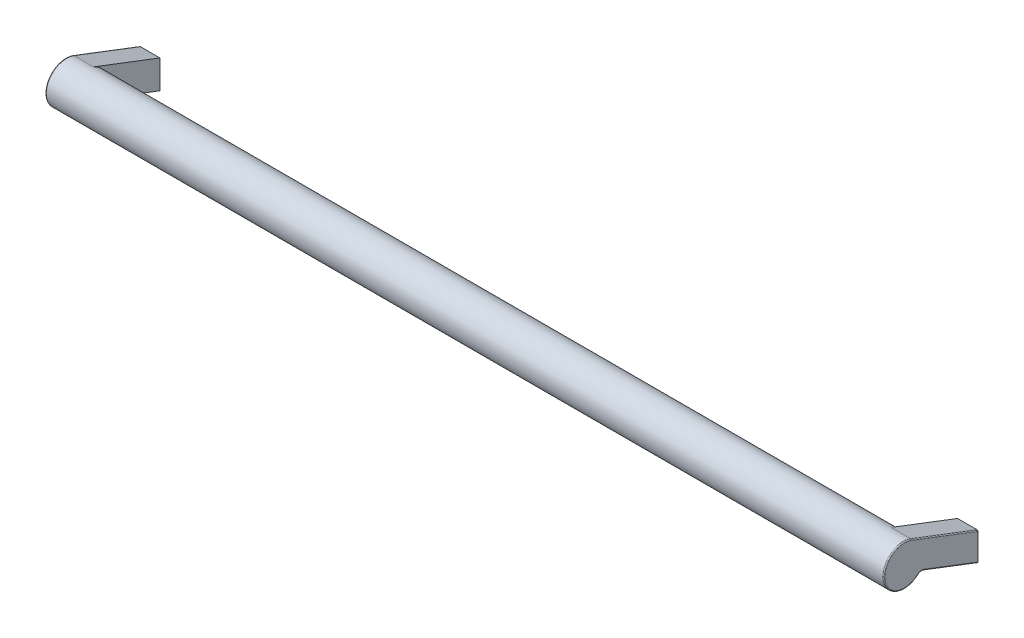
ISO-10303-21;
HEADER;
FILE_DESCRIPTION(('STEP AP214'),'2;1');
FILE_NAME('part.step','',(''),(''),'','','');
FILE_SCHEMA(('AUTOMOTIVE_DESIGN { 1 0 10303 214 1 1 1 1 }'));
ENDSEC;
DATA;
#1=APPLICATION_CONTEXT('core data for automotive mechanical design processes');
#2=APPLICATION_PROTOCOL_DEFINITION('international standard','automotive_design',2000,#1);
#3=PRODUCT_CONTEXT('',#1,'mechanical');
#4=PRODUCT('Part','Part','',(#3));
#5=PRODUCT_RELATED_PRODUCT_CATEGORY('part','',(#4));
#6=PRODUCT_DEFINITION_FORMATION('','',#4);
#7=PRODUCT_DEFINITION_CONTEXT('part definition',#1,'design');
#8=PRODUCT_DEFINITION('design','',#6,#7);
#9=PRODUCT_DEFINITION_SHAPE('','',#8);
#10=(LENGTH_UNIT() NAMED_UNIT(*) SI_UNIT(.MILLI.,.METRE.));
#11=(NAMED_UNIT(*) PLANE_ANGLE_UNIT() SI_UNIT($,.RADIAN.));
#12=(NAMED_UNIT(*) SI_UNIT($,.STERADIAN.) SOLID_ANGLE_UNIT());
#13=UNCERTAINTY_MEASURE_WITH_UNIT(LENGTH_MEASURE(1.E-05),#10,'distance_accuracy_value','');
#14=(GEOMETRIC_REPRESENTATION_CONTEXT(3) GLOBAL_UNCERTAINTY_ASSIGNED_CONTEXT((#13)) GLOBAL_UNIT_ASSIGNED_CONTEXT((#10,
#11,#12)) REPRESENTATION_CONTEXT('',''));
#15=CARTESIAN_POINT('',(0.,0.,0.));
#16=DIRECTION('',(0.,0.,1.));
#17=DIRECTION('',(1.,0.,0.));
#18=AXIS2_PLACEMENT_3D('',#15,#16,#17);
#19=CARTESIAN_POINT('',(145.,10.,36.));
#20=DIRECTION('',(1.,0.,0.));
#21=DIRECTION('',(0.,1.,0.));
#22=AXIS2_PLACEMENT_3D('',#19,#20,#21);
#23=CYLINDRICAL_SURFACE('',#22,10.);
#24=CARTESIAN_POINT('',(5.,10.,36.));
#25=DIRECTION('',(1.,0.,0.));
#26=DIRECTION('',(0.,1.,0.));
#27=AXIS2_PLACEMENT_3D('',#24,#25,#26);
#28=CIRCLE('',#27,10.);
#29=CARTESIAN_POINT('',(5.,2.30325569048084,29.6156341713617));
#30=VERTEX_POINT('',#29);
#31=CARTESIAN_POINT('',(5.,2.72629051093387,29.137555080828));
#32=VERTEX_POINT('',#31);
#33=EDGE_CURVE('E311',#30,#32,#28,.T.);
#34=ORIENTED_EDGE('',*,*,#33,.T.);
#35=CARTESIAN_POINT('',(5.,19.2986703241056,32.3210422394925));
#36=VERTEX_POINT('',#35);
#37=EDGE_CURVE('E38',#32,#36,#28,.T.);
#38=ORIENTED_EDGE('',*,*,#37,.T.);
#39=CARTESIAN_POINT('',(4.99999999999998,10.,36.));
#40=DIRECTION('',(1.,0.,0.));
#41=DIRECTION('',(0.,0.92986703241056,-0.367895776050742));
#42=AXIS2_PLACEMENT_3D('',#39,#40,#41);
#43=CIRCLE('',#42,10.);
#44=CARTESIAN_POINT('',(5.,19.3773951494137,32.5266068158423));
#45=VERTEX_POINT('',#44);
#46=EDGE_CURVE('E24',#36,#45,#43,.T.);
#47=ORIENTED_EDGE('',*,*,#46,.T.);
#48=DIRECTION('',(1.,0.,0.));
#49=VECTOR('',#48,1.);
#50=CARTESIAN_POINT('',(-5.,19.3773951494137,32.5266068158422));
#51=LINE('',#50,#49);
#52=CARTESIAN_POINT('',(-4.5,19.3773951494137,32.5266068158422));
#53=VERTEX_POINT('',#52);
#54=EDGE_CURVE('E463',#45,#53,#51,.F.);
#55=ORIENTED_EDGE('',*,*,#54,.T.);
#56=CARTESIAN_POINT('',(-4.5,10.,36.));
#57=DIRECTION('',(1.,0.,0.));
#58=DIRECTION('',(0.,1.,0.));
#59=AXIS2_PLACEMENT_3D('',#56,#57,#58);
#60=CIRCLE('',#59,10.);
#61=CARTESIAN_POINT('',(-4.5,2.30325569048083,29.6156341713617));
#62=VERTEX_POINT('',#61);
#63=EDGE_CURVE('E393',#62,#53,#60,.F.);
#64=ORIENTED_EDGE('',*,*,#63,.F.);
#65=DIRECTION('',(1.,0.,0.));
#66=VECTOR('',#65,1.);
#67=CARTESIAN_POINT('',(-5.,2.30325569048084,29.6156341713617));
#68=LINE('',#67,#66);
#69=EDGE_CURVE('E454',#62,#30,#68,.T.);
#70=ORIENTED_EDGE('',*,*,#69,.T.);
#71=EDGE_LOOP('',(#34,#38,#47,#55,#64,#70));
#72=FACE_BOUND('',#71,.T.);
#73=DIRECTION('',(1.,0.,0.));
#74=VECTOR('',#73,1.);
#75=CARTESIAN_POINT('',(395.,2.30325569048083,29.6156341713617));
#76=LINE('',#75,#74);
#77=CARTESIAN_POINT('',(395.,2.30325569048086,29.6156341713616));
#78=VERTEX_POINT('',#77);
#79=CARTESIAN_POINT('',(404.5,2.30325569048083,29.6156341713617));
#80=VERTEX_POINT('',#79);
#81=EDGE_CURVE('E198',#78,#80,#76,.T.);
#82=ORIENTED_EDGE('',*,*,#81,.T.);
#83=CARTESIAN_POINT('',(404.5,10.,36.));
#84=DIRECTION('',(1.,0.,0.));
#85=DIRECTION('',(0.,1.,0.));
#86=AXIS2_PLACEMENT_3D('',#83,#84,#85);
#87=CIRCLE('',#86,10.);
#88=CARTESIAN_POINT('',(404.5,19.3773951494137,32.5266068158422));
#89=VERTEX_POINT('',#88);
#90=EDGE_CURVE('E594',#89,#80,#87,.T.);
#91=ORIENTED_EDGE('',*,*,#90,.F.);
#92=DIRECTION('',(1.,0.,0.));
#93=VECTOR('',#92,1.);
#94=CARTESIAN_POINT('',(395.,19.3773951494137,32.5266068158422));
#95=LINE('',#94,#93);
#96=CARTESIAN_POINT('',(395.,19.3773951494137,32.5266068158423));
#97=VERTEX_POINT('',#96);
#98=EDGE_CURVE('E160',#89,#97,#95,.F.);
#99=ORIENTED_EDGE('',*,*,#98,.T.);
#100=CARTESIAN_POINT('',(395.,10.,36.));
#101=DIRECTION('',(-1.,0.,0.));
#102=DIRECTION('',(0.,0.937739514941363,-0.347339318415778));
#103=AXIS2_PLACEMENT_3D('',#100,#101,#102);
#104=CIRCLE('',#103,10.);
#105=CARTESIAN_POINT('',(395.,19.2986703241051,32.3210422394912));
#106=VERTEX_POINT('',#105);
#107=EDGE_CURVE('E154',#97,#106,#104,.T.);
#108=ORIENTED_EDGE('',*,*,#107,.T.);
#109=CARTESIAN_POINT('',(395.,10.,36.));
#110=DIRECTION('',(1.,0.,0.));
#111=DIRECTION('',(0.,1.,0.));
#112=AXIS2_PLACEMENT_3D('',#109,#110,#111);
#113=CIRCLE('',#112,10.);
#114=CARTESIAN_POINT('',(395.,2.72629051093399,29.1375550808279));
#115=VERTEX_POINT('',#114);
#116=EDGE_CURVE('E157',#115,#106,#113,.T.);
#117=ORIENTED_EDGE('',*,*,#116,.F.);
#118=CARTESIAN_POINT('',(395.,10.,36.));
#119=DIRECTION('',(1.,0.,0.));
#120=DIRECTION('',(0.,1.,0.));
#121=AXIS2_PLACEMENT_3D('',#118,#119,#120);
#122=CIRCLE('',#121,10.);
#123=EDGE_CURVE('E572',#115,#78,#122,.F.);
#124=ORIENTED_EDGE('',*,*,#123,.T.);
#125=EDGE_LOOP('',(#82,#91,#99,#108,#117,#124));
#126=FACE_BOUND('',#125,.T.);
#127=ADVANCED_FACE('F14',(#72,#126),#23,.T.);
#128=CARTESIAN_POINT('',(0.,0.,6.));
#129=DIRECTION('',(0.,0.,-1.));
#130=DIRECTION('',(1.,0.,0.));
#131=AXIS2_PLACEMENT_3D('',#128,#129,#130);
#132=PLANE('',#131);
#133=CARTESIAN_POINT('',(0.,0.,6.));
#134=DIRECTION('',(0.,0.,-1.));
#135=DIRECTION('',(1.,0.,0.));
#136=AXIS2_PLACEMENT_3D('',#133,#134,#135);
#137=CIRCLE('',#136,2.);
#138=CARTESIAN_POINT('',(2.,0.,6.));
#139=VERTEX_POINT('',#138);
#140=EDGE_CURVE('E550',#139,#139,#137,.T.);
#141=ORIENTED_EDGE('',*,*,#140,.T.);
#142=EDGE_LOOP('',(#141));
#143=FACE_BOUND('',#142,.T.);
#144=ADVANCED_FACE('F273',(#143),#132,.T.);
#145=CARTESIAN_POINT('',(-5.,0.280812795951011,27.3998443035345));
#146=DIRECTION('',(1.,0.,0.));
#147=DIRECTION('',(0.,1.,0.));
#148=AXIS2_PLACEMENT_3D('',#145,#146,#147);
#149=PLANE('',#148);
#150=CARTESIAN_POINT('',(-5.,10.,36.));
#151=DIRECTION('',(1.,0.,0.));
#152=DIRECTION('',(0.,1.,0.));
#153=AXIS2_PLACEMENT_3D('',#150,#151,#152);
#154=CIRCLE('',#153,9.5);
#155=CARTESIAN_POINT('',(-5.,19.5,36.));
#156=VERTEX_POINT('',#155);
#157=CARTESIAN_POINT('',(-5.,0.500000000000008,36.));
#158=VERTEX_POINT('',#157);
#159=EDGE_CURVE('E328',#156,#158,#154,.T.);
#160=ORIENTED_EDGE('',*,*,#159,.F.);
#161=CARTESIAN_POINT('',(-5.,10.,36.));
#162=DIRECTION('',(1.,0.,0.));
#163=DIRECTION('',(0.,0.937838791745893,-0.347071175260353));
#164=AXIS2_PLACEMENT_3D('',#161,#162,#163);
#165=CIRCLE('',#164,9.49999999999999);
#166=CARTESIAN_POINT('',(-5.,18.909468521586,32.7028238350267));
#167=VERTEX_POINT('',#166);
#168=EDGE_CURVE('E333',#167,#156,#165,.T.);
#169=ORIENTED_EDGE('',*,*,#168,.F.);
#170=DIRECTION('',(0.,0.357639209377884,0.933859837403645));
#171=VECTOR('',#170,1.);
#172=CARTESIAN_POINT('',(-5.,6.38530633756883,0.));
#173=LINE('',#172,#171);
#174=CARTESIAN_POINT('',(-5.,6.38530633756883,0.));
#175=VERTEX_POINT('',#174);
#176=EDGE_CURVE('E336',#175,#167,#173,.T.);
#177=ORIENTED_EDGE('',*,*,#176,.F.);
#178=DIRECTION('',(0.,1.,0.));
#179=VECTOR('',#178,1.);
#180=CARTESIAN_POINT('',(-5.,0.280812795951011,0.));
#181=LINE('',#180,#179);
#182=CARTESIAN_POINT('',(-5.,-6.46458774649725,0.));
#183=VERTEX_POINT('',#182);
#184=EDGE_CURVE('E340',#183,#175,#181,.T.);
#185=ORIENTED_EDGE('',*,*,#184,.F.);
#186=DIRECTION('',(0.,-0.357639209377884,-0.933859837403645));
#187=VECTOR('',#186,1.);
#188=CARTESIAN_POINT('',(-5.,3.54932222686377,26.1481070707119));
#189=LINE('',#188,#187);
#190=CARTESIAN_POINT('',(-5.,3.54932222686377,26.1481070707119));
#191=VERTEX_POINT('',#190);
#192=EDGE_CURVE('E346',#191,#183,#189,.T.);
#193=ORIENTED_EDGE('',*,*,#192,.F.);
#194=CARTESIAN_POINT('',(-5.,0.280812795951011,27.3998443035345));
#195=DIRECTION('',(-1.,0.,0.));
#196=DIRECTION('',(0.,1.,0.));
#197=AXIS2_PLACEMENT_3D('',#194,#195,#196);
#198=CIRCLE('',#197,3.5);
#199=CARTESIAN_POINT('',(-5.,3.78081279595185,27.3998443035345));
#200=VERTEX_POINT('',#199);
#201=EDGE_CURVE('E358',#200,#191,#198,.T.);
#202=ORIENTED_EDGE('',*,*,#201,.F.);
#203=CARTESIAN_POINT('',(-5.,0.280812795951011,27.3998443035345));
#204=DIRECTION('',(-1.,0.,0.));
#205=DIRECTION('',(0.,0.681805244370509,0.731533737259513));
#206=AXIS2_PLACEMENT_3D('',#203,#204,#205);
#207=CIRCLE('',#206,3.50000000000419);
#208=CARTESIAN_POINT('',(-5.,2.66713115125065,29.9602123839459));
#209=VERTEX_POINT('',#208);
#210=EDGE_CURVE('E400',#209,#200,#207,.T.);
#211=ORIENTED_EDGE('',*,*,#210,.F.);
#212=CARTESIAN_POINT('',(-5.,10.,36.));
#213=DIRECTION('',(1.,0.,0.));
#214=DIRECTION('',(0.,-1.,0.));
#215=AXIS2_PLACEMENT_3D('',#212,#213,#214);
#216=CIRCLE('',#215,9.5);
#217=EDGE_CURVE('E319',#158,#209,#216,.T.);
#218=ORIENTED_EDGE('',*,*,#217,.F.);
#219=EDGE_LOOP('',(#160,#169,#177,#185,#193,#202,#211,#218));
#220=FACE_BOUND('',#219,.T.);
#221=ADVANCED_FACE('F276',(#220),#149,.F.);
#222=CARTESIAN_POINT('',(0.,0.,6.));
#223=DIRECTION('',(0.,0.,-1.));
#224=DIRECTION('',(1.,0.,0.));
#225=AXIS2_PLACEMENT_3D('',#222,#223,#224);
#226=CYLINDRICAL_SURFACE('',#225,2.);
#227=ORIENTED_EDGE('',*,*,#140,.F.);
#228=EDGE_LOOP('',(#227));
#229=FACE_BOUND('',#228,.T.);
#230=CARTESIAN_POINT('',(0.,0.,0.));
#231=DIRECTION('',(0.,0.,-1.));
#232=DIRECTION('',(1.,0.,0.));
#233=AXIS2_PLACEMENT_3D('',#230,#231,#232);
#234=CIRCLE('',#233,2.);
#235=CARTESIAN_POINT('',(2.,0.,0.));
#236=VERTEX_POINT('',#235);
#237=EDGE_CURVE('E569',#236,#236,#234,.T.);
#238=ORIENTED_EDGE('',*,*,#237,.T.);
#239=EDGE_LOOP('',(#238));
#240=FACE_BOUND('',#239,.T.);
#241=ADVANCED_FACE('F278',(#229,#240),#226,.F.);
#242=CARTESIAN_POINT('',(-4.5,3.54932222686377,26.1481070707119));
#243=DIRECTION('',(0.,0.357639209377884,0.933859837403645));
#244=DIRECTION('',(0.,0.933859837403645,-0.357639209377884));
#245=AXIS2_PLACEMENT_3D('',#242,#243,#244);
#246=CYLINDRICAL_SURFACE('',#245,0.5);
#247=CARTESIAN_POINT('',(-4.5,3.54932222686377,26.1481070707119));
#248=DIRECTION('',(0.,0.357639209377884,0.933859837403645));
#249=DIRECTION('',(0.,0.933859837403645,-0.357639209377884));
#250=AXIS2_PLACEMENT_3D('',#247,#248,#249);
#251=CIRCLE('',#250,0.5);
#252=CARTESIAN_POINT('',(-4.5,3.08239230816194,26.3269266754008));
#253=VERTEX_POINT('',#252);
#254=EDGE_CURVE('E515',#253,#191,#251,.F.);
#255=ORIENTED_EDGE('',*,*,#254,.T.);
#256=ORIENTED_EDGE('',*,*,#192,.T.);
#257=CARTESIAN_POINT('',(-4.5,-6.46458774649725,0.));
#258=DIRECTION('',(0.,0.,1.));
#259=DIRECTION('',(0.,1.,0.));
#260=AXIS2_PLACEMENT_3D('',#257,#258,#259);
#261=ELLIPSE('',#260,0.535412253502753,0.5);
#262=CARTESIAN_POINT('',(-4.5,-7.,0.));
#263=VERTEX_POINT('',#262);
#264=EDGE_CURVE('E467',#183,#263,#261,.T.);
#265=ORIENTED_EDGE('',*,*,#264,.T.);
#266=DIRECTION('',(0.,0.357639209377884,0.933859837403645));
#267=VECTOR('',#266,1.);
#268=CARTESIAN_POINT('',(-4.5,3.08239230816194,26.3269266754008));
#269=LINE('',#268,#267);
#270=EDGE_CURVE('E560',#263,#253,#269,.T.);
#271=ORIENTED_EDGE('',*,*,#270,.T.);
#272=EDGE_LOOP('',(#255,#256,#265,#271));
#273=FACE_BOUND('',#272,.T.);
#274=ADVANCED_FACE('F281',(#273),#246,.T.);
#275=CARTESIAN_POINT('',(-4.5,0.280812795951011,27.3998443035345));
#276=DIRECTION('',(1.,0.,0.));
#277=DIRECTION('',(0.,1.,0.));
#278=AXIS2_PLACEMENT_3D('',#275,#276,#277);
#279=TOROIDAL_SURFACE('',#278,3.5,0.5);
#280=ORIENTED_EDGE('',*,*,#201,.T.);
#281=ORIENTED_EDGE('',*,*,#254,.F.);
#282=CARTESIAN_POINT('',(-4.5,0.280812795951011,27.3998443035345));
#283=DIRECTION('',(1.,0.,0.));
#284=DIRECTION('',(0.,1.,0.));
#285=AXIS2_PLACEMENT_3D('',#282,#283,#284);
#286=CIRCLE('',#285,3.);
#287=EDGE_CURVE('E528',#253,#62,#286,.T.);
#288=ORIENTED_EDGE('',*,*,#287,.T.);
#289=CARTESIAN_POINT('',(-5.,2.66713115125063,29.9602123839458));
#290=CARTESIAN_POINT('',(-5.00000003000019,2.66325531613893,29.956566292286));
#291=CARTESIAN_POINT('',(-4.99991542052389,2.65937931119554,29.9529203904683));
#292=CARTESIAN_POINT('',(-4.99957964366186,2.65168852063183,29.9456865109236));
#293=CARTESIAN_POINT('',(-4.99933096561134,2.64787367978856,29.9420984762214));
#294=CARTESIAN_POINT('',(-4.99867470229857,2.64030893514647,29.9349834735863));
#295=CARTESIAN_POINT('',(-4.99826956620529,2.63655891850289,29.9314563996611));
#296=CARTESIAN_POINT('',(-4.99730810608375,2.62912719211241,29.9244661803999));
#297=CARTESIAN_POINT('',(-4.99675418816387,2.62544531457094,29.9210028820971));
#298=CARTESIAN_POINT('',(-4.99550284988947,2.61815283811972,29.9141427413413));
#299=CARTESIAN_POINT('',(-4.99480779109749,2.61454202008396,29.9107457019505));
#300=CARTESIAN_POINT('',(-4.99328190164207,2.60739448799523,29.9040205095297));
#301=CARTESIAN_POINT('',(-4.9924533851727,2.60385750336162,29.9006921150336));
#302=CARTESIAN_POINT('',(-4.98979715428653,2.59344591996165,29.8908929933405));
#303=CARTESIAN_POINT('',(-4.98776893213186,2.58659856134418,29.8844464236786));
#304=CARTESIAN_POINT('',(-4.98325124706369,2.57322647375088,29.8718515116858));
#305=CARTESIAN_POINT('',(-4.98077911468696,2.56669853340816,29.8657003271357));
#306=CARTESIAN_POINT('',(-4.97543268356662,2.55397558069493,29.8537052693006));
#307=CARTESIAN_POINT('',(-4.97257488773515,2.54777678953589,29.8478580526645));
#308=CARTESIAN_POINT('',(-4.96651445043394,2.53571898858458,29.8364772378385));
#309=CARTESIAN_POINT('',(-4.96332745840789,2.52985569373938,29.8309398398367));
#310=CARTESIAN_POINT('',(-4.95666365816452,2.51847178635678,29.8201816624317));
#311=CARTESIAN_POINT('',(-4.95320163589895,2.51294647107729,29.8149566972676));
#312=CARTESIAN_POINT('',(-4.94604029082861,2.50223812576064,29.8048236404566));
#313=CARTESIAN_POINT('',(-4.94235488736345,2.49705005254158,29.7999110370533));
#314=CARTESIAN_POINT('',(-4.93479656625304,2.4870128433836,29.7904004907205));
#315=CARTESIAN_POINT('',(-4.93093670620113,2.48215839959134,29.7857977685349));
#316=CARTESIAN_POINT('',(-4.92307639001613,2.47278256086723,29.7769026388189));
#317=CARTESIAN_POINT('',(-4.91908814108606,2.46825566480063,29.7726052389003));
#318=CARTESIAN_POINT('',(-4.91101501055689,2.45952686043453,29.7643145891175));
#319=CARTESIAN_POINT('',(-4.90694150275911,2.45531932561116,29.7603161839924));
#320=CARTESIAN_POINT('',(-4.89873881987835,2.44721938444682,29.7526158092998));
#321=CARTESIAN_POINT('',(-4.89462020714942,2.44332128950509,29.7489085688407));
#322=CARTESIAN_POINT('',(-4.88636530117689,2.43582884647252,29.741781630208));
#323=CARTESIAN_POINT('',(-4.88223878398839,2.43222880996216,29.7383565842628));
#324=CARTESIAN_POINT('',(-4.87400305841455,2.42532009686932,29.7317838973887));
#325=CARTESIAN_POINT('',(-4.86990287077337,2.42200578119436,29.7286308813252));
#326=CARTESIAN_POINT('',(-4.8617520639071,2.41565469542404,29.7225922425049));
#327=CARTESIAN_POINT('',(-4.85770973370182,2.41261241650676,29.7197012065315));
#328=CARTESIAN_POINT('',(-4.84750942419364,2.40519799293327,29.7126579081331));
#329=CARTESIAN_POINT('',(-4.84126564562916,2.40088697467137,29.7085649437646));
#330=CARTESIAN_POINT('',(-4.82852259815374,2.39253353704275,29.700632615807));
#331=CARTESIAN_POINT('',(-4.82202532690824,2.38848950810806,29.6967917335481));
#332=CARTESIAN_POINT('',(-4.80879791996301,2.38067518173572,29.6893695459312));
#333=CARTESIAN_POINT('',(-4.80206965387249,2.37690321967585,29.6857866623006));
#334=CARTESIAN_POINT('',(-4.78840324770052,2.36963825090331,29.6788847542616));
#335=CARTESIAN_POINT('',(-4.78146684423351,2.36614352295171,29.6755641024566));
#336=CARTESIAN_POINT('',(-4.76740696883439,2.35943688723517,29.6691902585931));
#337=CARTESIAN_POINT('',(-4.76028509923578,2.35622320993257,29.6661353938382));
#338=CARTESIAN_POINT('',(-4.74587696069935,2.35008160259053,29.660295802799));
#339=CARTESIAN_POINT('',(-4.73859215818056,2.34715186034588,29.6575093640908));
#340=CARTESIAN_POINT('',(-4.72388058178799,2.34158004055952,29.6522084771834));
#341=CARTESIAN_POINT('',(-4.71645513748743,2.3389361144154,29.6496922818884));
#342=CARTESIAN_POINT('',(-4.7014844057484,2.33393689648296,29.6449329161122));
#343=CARTESIAN_POINT('',(-4.69394031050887,2.33157972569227,29.6426879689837));
#344=CARTESIAN_POINT('',(-4.67875404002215,2.32715406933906,29.6384713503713));
#345=CARTESIAN_POINT('',(-4.67111291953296,2.32508368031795,29.6364978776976));
#346=CARTESIAN_POINT('',(-4.65575393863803,2.32123075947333,29.6328237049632));
#347=CARTESIAN_POINT('',(-4.6480369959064,2.31944630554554,29.631121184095));
#348=CARTESIAN_POINT('',(-4.63254723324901,2.31616358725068,29.6279876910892));
#349=CARTESIAN_POINT('',(-4.62477519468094,2.31466338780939,29.6265548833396));
#350=CARTESIAN_POINT('',(-4.60919557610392,2.31194671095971,29.6239589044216));
#351=CARTESIAN_POINT('',(-4.60138864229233,2.31072829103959,29.6227938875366));
#352=CARTESIAN_POINT('',(-4.5857589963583,2.30857195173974,29.6207309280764));
#353=CARTESIAN_POINT('',(-4.57793679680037,2.30763208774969,29.6198311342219));
#354=CARTESIAN_POINT('',(-4.56229576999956,2.30602891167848,29.6182954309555));
#355=CARTESIAN_POINT('',(-4.55447732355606,2.30536365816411,29.6176576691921));
#356=CARTESIAN_POINT('',(-4.53886230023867,2.30430512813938,29.6166422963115));
#357=CARTESIAN_POINT('',(-4.53106597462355,2.30390991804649,29.6162628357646));
#358=CARTESIAN_POINT('',(-4.51551301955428,2.30338610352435,29.6157596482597));
#359=CARTESIAN_POINT('',(-4.50775651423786,2.30325557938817,29.6156340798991));
#360=CARTESIAN_POINT('',(-4.5,2.30325569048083,29.6156341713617));
#361=B_SPLINE_CURVE_WITH_KNOTS('',3,(#289,#290,#291,#292,#293,#294,#295,#296,#297,#298,#299,
#300,#301,#302,#303,#304,#305,#306,#307,#308,#309,#310,#311,#312,#313,#314,#315,#316,#317,#318,
#319,#320,#321,#322,#323,#324,#325,#326,#327,#328,#329,#330,#331,#332,#333,#334,#335,#336,#337,
#338,#339,#340,#341,#342,#343,#344,#345,#346,#347,#348,#349,#350,#351,#352,#353,#354,#355,#356,
#357,#358,#359,#360),.UNSPECIFIED.,.F.,.F.,(4,2,2,2,2,2,2,2,2,2,2,2,2,2,2,2,2,2,2,2,2,2,2,2,2,2,
2,2,2,2,2,2,2,2,2,4),(0.,0.015963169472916,0.0316895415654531,0.0471791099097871,
0.0624318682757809,0.0774478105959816,0.0922269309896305,0.12107170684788,0.148969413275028,
0.175919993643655,0.201923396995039,0.226979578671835,0.251088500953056,0.274250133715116,
0.296464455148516,0.317731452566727,0.338051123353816,0.357423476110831,0.375848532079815,
0.393326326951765,0.419177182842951,0.444854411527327,0.470358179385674,0.495688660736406,
0.520846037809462,0.54583050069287,0.570642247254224,0.595281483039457,0.619748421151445,
0.644043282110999,0.668166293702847,0.692117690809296,0.715897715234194,0.739506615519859,
0.762944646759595,0.786212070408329),.UNSPECIFIED.);
#362=EDGE_CURVE('E388',#209,#62,#361,.T.);
#363=ORIENTED_EDGE('',*,*,#362,.F.);
#364=ORIENTED_EDGE('',*,*,#210,.T.);
#365=EDGE_LOOP('',(#280,#281,#288,#363,#364));
#366=FACE_BOUND('',#365,.T.);
#367=ADVANCED_FACE('F301',(#366),#279,.T.);
#368=CARTESIAN_POINT('',(-4.5,10.,36.));
#369=DIRECTION('',(1.,0.,0.));
#370=DIRECTION('',(0.,1.,0.));
#371=AXIS2_PLACEMENT_3D('',#368,#369,#370);
#372=TOROIDAL_SURFACE('',#371,9.5,0.5);
#373=ORIENTED_EDGE('',*,*,#362,.T.);
#374=ORIENTED_EDGE('',*,*,#63,.T.);
#375=CARTESIAN_POINT('',(-4.5,19.3773951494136,32.5266068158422));
#376=CARTESIAN_POINT('',(-4.50818123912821,19.3774056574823,32.5266346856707));
#377=CARTESIAN_POINT('',(-4.5163624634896,19.3772275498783,32.526732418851));
#378=CARTESIAN_POINT('',(-4.53270521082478,19.3764952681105,32.5270671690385));
#379=CARTESIAN_POINT('',(-4.54086673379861,19.3759410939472,32.5273041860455));
#380=CARTESIAN_POINT('',(-4.557150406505,19.3744578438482,32.5279170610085));
#381=CARTESIAN_POINT('',(-4.56527255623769,19.3735287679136,32.5282929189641));
#382=CARTESIAN_POINT('',(-4.58145791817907,19.3712980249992,32.5291826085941));
#383=CARTESIAN_POINT('',(-4.58952113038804,19.3699963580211,32.5296964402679));
#384=CARTESIAN_POINT('',(-4.60556919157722,19.3670235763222,32.530860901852));
#385=CARTESIAN_POINT('',(-4.61355404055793,19.3653524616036,32.5315115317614));
#386=CARTESIAN_POINT('',(-4.62942613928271,19.361644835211,32.532948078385));
#387=CARTESIAN_POINT('',(-4.63731338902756,19.3596083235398,32.5337339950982));
#388=CARTESIAN_POINT('',(-4.65297128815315,19.3551748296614,32.5354392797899));
#389=CARTESIAN_POINT('',(-4.66074193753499,19.3527778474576,32.5363586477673));
#390=CARTESIAN_POINT('',(-4.67614791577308,19.3476292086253,32.5383286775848));
#391=CARTESIAN_POINT('',(-4.68378324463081,19.3448775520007,32.5393793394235));
#392=CARTESIAN_POINT('',(-4.69890018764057,19.3390262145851,32.5416094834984));
#393=CARTESIAN_POINT('',(-4.70638180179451,19.3359265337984,32.542788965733));
#394=CARTESIAN_POINT('',(-4.72117329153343,19.3293866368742,32.5452739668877));
#395=CARTESIAN_POINT('',(-4.72848316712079,19.3259464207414,32.5465794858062));
#396=CARTESIAN_POINT('',(-4.74291356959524,19.3187337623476,32.5493134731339));
#397=CARTESIAN_POINT('',(-4.75003409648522,19.3149613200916,32.5507419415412));
#398=CARTESIAN_POINT('',(-4.7640686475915,19.3070933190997,32.5537184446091));
#399=CARTESIAN_POINT('',(-4.77098267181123,19.3029977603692,32.5552664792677));
#400=CARTESIAN_POINT('',(-4.7845875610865,19.294493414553,32.5584784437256));
#401=CARTESIAN_POINT('',(-4.79127842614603,19.2900846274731,32.5601423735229));
#402=CARTESIAN_POINT('',(-4.80442087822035,19.2809644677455,32.5635821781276));
#403=CARTESIAN_POINT('',(-4.81087246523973,19.2762530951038,32.5653580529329));
#404=CARTESIAN_POINT('',(-4.82352081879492,19.2665391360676,32.5690175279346));
#405=CARTESIAN_POINT('',(-4.82971758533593,19.2615365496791,32.570901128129));
#406=CARTESIAN_POINT('',(-4.84184136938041,19.251252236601,32.5747715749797));
#407=CARTESIAN_POINT('',(-4.84776838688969,19.2459705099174,32.5767584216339));
#408=CARTESIAN_POINT('',(-4.85933839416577,19.2351406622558,32.5808306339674));
#409=CARTESIAN_POINT('',(-4.864981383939,19.2295925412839,32.5829159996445));
#410=CARTESIAN_POINT('',(-4.87596974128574,19.2182432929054,32.5871802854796));
#411=CARTESIAN_POINT('',(-4.88131510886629,19.212442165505,32.5893592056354));
#412=CARTESIAN_POINT('',(-4.89169534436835,19.2006009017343,32.5938054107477));
#413=CARTESIAN_POINT('',(-4.89673021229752,19.1945607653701,32.5960726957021));
#414=CARTESIAN_POINT('',(-4.90647731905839,19.1822560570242,32.6006902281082));
#415=CARTESIAN_POINT('',(-4.91118955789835,19.1759914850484,32.6030404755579));
#416=CARTESIAN_POINT('',(-4.92028005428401,19.1632530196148,32.6078183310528));
#417=CARTESIAN_POINT('',(-4.92465831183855,19.1567791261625,32.6102459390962));
#418=CARTESIAN_POINT('',(-4.93307029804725,19.1436376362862,32.615172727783));
#419=CARTESIAN_POINT('',(-4.93710402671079,19.1369700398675,32.6176719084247));
#420=CARTESIAN_POINT('',(-4.94481723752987,19.1234572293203,32.6227358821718));
#421=CARTESIAN_POINT('',(-4.9484967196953,19.1166120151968,32.6253006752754));
#422=CARTESIAN_POINT('',(-4.95549257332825,19.1027604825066,32.630489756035));
#423=CARTESIAN_POINT('',(-4.95880894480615,19.0957541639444,32.6331140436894));
#424=CARTESIAN_POINT('',(-4.96507058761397,19.0815973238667,32.6384158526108));
#425=CARTESIAN_POINT('',(-4.9680158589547,19.0744468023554,32.6410933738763));
#426=CARTESIAN_POINT('',(-4.97352820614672,19.0600188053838,32.6464952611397));
#427=CARTESIAN_POINT('',(-4.97609528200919,19.0527413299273,32.6492196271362));
#428=CARTESIAN_POINT('',(-4.98084505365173,19.038076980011,32.6547087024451));
#429=CARTESIAN_POINT('',(-4.98302774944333,19.0306901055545,32.6574734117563));
#430=CARTESIAN_POINT('',(-4.98700350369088,19.015824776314,32.6630365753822));
#431=CARTESIAN_POINT('',(-4.98879656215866,19.0083463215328,32.6658350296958));
#432=CARTESIAN_POINT('',(-4.99198871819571,18.9933158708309,32.6714590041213));
#433=CARTESIAN_POINT('',(-4.99338781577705,18.9857638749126,32.6742845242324));
#434=CARTESIAN_POINT('',(-4.99578869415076,18.9706045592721,32.6799558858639));
#435=CARTESIAN_POINT('',(-4.99679047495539,18.9629972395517,32.6828017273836));
#436=CARTESIAN_POINT('',(-4.99839425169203,18.9477456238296,32.6885069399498));
#437=CARTESIAN_POINT('',(-4.9989962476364,18.9401013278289,32.6913663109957));
#438=CARTESIAN_POINT('',(-4.99979920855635,18.9247942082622,32.6970917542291));
#439=CARTESIAN_POINT('',(-5.00000017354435,18.9171313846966,32.6999578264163));
#440=CARTESIAN_POINT('',(-5.,18.909468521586,32.7028238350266));
#441=B_SPLINE_CURVE_WITH_KNOTS('',3,(#375,#376,#377,#378,#379,#380,#381,#382,#383,#384,#385,
#386,#387,#388,#389,#390,#391,#392,#393,#394,#395,#396,#397,#398,#399,#400,#401,#402,#403,#404,
#405,#406,#407,#408,#409,#410,#411,#412,#413,#414,#415,#416,#417,#418,#419,#420,#421,#422,#423,
#424,#425,#426,#427,#428,#429,#430,#431,#432,#433,#434,#435,#436,#437,#438,#439,#440),
.UNSPECIFIED.,.F.,.F.,(4,2,2,2,2,2,2,2,2,2,2,2,2,2,2,2,2,2,2,2,2,2,2,2,2,2,2,2,2,2,2,2,4),(0.,
0.0245413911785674,0.0490827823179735,0.0736241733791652,0.0981655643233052,0.122706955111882,
0.147248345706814,0.171789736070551,0.196331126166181,0.220872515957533,0.245413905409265,
0.26995529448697,0.294496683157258,0.319038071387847,0.343579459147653,0.368120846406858,
0.392662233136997,0.417203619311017,0.441745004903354,0.466286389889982,0.490827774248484,
0.515369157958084,0.539910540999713,0.564451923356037,0.588993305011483,0.613534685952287,
0.638076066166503,0.662617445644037,0.68715882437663,0.711700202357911,0.736241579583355,
0.760782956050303,0.785324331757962),.UNSPECIFIED.);
#442=EDGE_CURVE('E479',#53,#167,#441,.T.);
#443=ORIENTED_EDGE('',*,*,#442,.T.);
#444=ORIENTED_EDGE('',*,*,#168,.T.);
#445=ORIENTED_EDGE('',*,*,#159,.T.);
#446=ORIENTED_EDGE('',*,*,#217,.T.);
#447=EDGE_LOOP('',(#373,#374,#443,#444,#445,#446));
#448=FACE_BOUND('',#447,.T.);
#449=ADVANCED_FACE('F365',(#448),#372,.T.);
#450=CARTESIAN_POINT('',(-4.5,14.7556402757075,21.8564365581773));
#451=DIRECTION('',(0.,-0.357639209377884,-0.933859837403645));
#452=DIRECTION('',(0.,-0.933859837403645,0.357639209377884));
#453=AXIS2_PLACEMENT_3D('',#450,#451,#452);
#454=CYLINDRICAL_SURFACE('',#453,0.5);
#455=CARTESIAN_POINT('',(-4.5,6.38530633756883,0.));
#456=DIRECTION('',(0.,0.,1.));
#457=DIRECTION('',(0.,-1.,0.));
#458=AXIS2_PLACEMENT_3D('',#455,#456,#457);
#459=ELLIPSE('',#458,0.535412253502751,0.5);
#460=CARTESIAN_POINT('',(-4.5,6.92071859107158,0.));
#461=VERTEX_POINT('',#460);
#462=EDGE_CURVE('E551',#461,#175,#459,.T.);
#463=ORIENTED_EDGE('',*,*,#462,.T.);
#464=ORIENTED_EDGE('',*,*,#176,.T.);
#465=ORIENTED_EDGE('',*,*,#442,.F.);
#466=DIRECTION('',(0.,-0.357639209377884,-0.933859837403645));
#467=VECTOR('',#466,1.);
#468=CARTESIAN_POINT('',(-4.5,15.2225701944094,21.6776169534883));
#469=LINE('',#468,#467);
#470=EDGE_CURVE('E552',#53,#461,#469,.T.);
#471=ORIENTED_EDGE('',*,*,#470,.T.);
#472=EDGE_LOOP('',(#463,#464,#465,#471));
#473=FACE_BOUND('',#472,.T.);
#474=ADVANCED_FACE('F375',(#473),#454,.T.);
#475=CARTESIAN_POINT('',(-5.,6.92071859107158,0.));
#476=DIRECTION('',(0.,0.,1.));
#477=DIRECTION('',(-1.,0.,0.));
#478=AXIS2_PLACEMENT_3D('',#475,#476,#477);
#479=PLANE('',#478);
#480=ORIENTED_EDGE('',*,*,#237,.F.);
#481=EDGE_LOOP('',(#480));
#482=FACE_BOUND('',#481,.T.);
#483=ORIENTED_EDGE('',*,*,#462,.F.);
#484=DIRECTION('',(-1.,0.,0.));
#485=VECTOR('',#484,1.);
#486=CARTESIAN_POINT('',(-5.,6.92071859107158,0.));
#487=LINE('',#486,#485);
#488=CARTESIAN_POINT('',(5.,6.92071859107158,0.));
#489=VERTEX_POINT('',#488);
#490=EDGE_CURVE('E548',#489,#461,#487,.T.);
#491=ORIENTED_EDGE('',*,*,#490,.F.);
#492=DIRECTION('',(0.,-1.,0.));
#493=VECTOR('',#492,1.);
#494=CARTESIAN_POINT('',(5.,6.92071859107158,0.));
#495=LINE('',#494,#493);
#496=CARTESIAN_POINT('',(5.,-7.,0.));
#497=VERTEX_POINT('',#496);
#498=EDGE_CURVE('E545',#497,#489,#495,.F.);
#499=ORIENTED_EDGE('',*,*,#498,.F.);
#500=DIRECTION('',(-1.,0.,0.));
#501=VECTOR('',#500,1.);
#502=CARTESIAN_POINT('',(-5.,-7.,0.));
#503=LINE('',#502,#501);
#504=EDGE_CURVE('E549',#263,#497,#503,.F.);
#505=ORIENTED_EDGE('',*,*,#504,.F.);
#506=ORIENTED_EDGE('',*,*,#264,.F.);
#507=ORIENTED_EDGE('',*,*,#184,.T.);
#508=EDGE_LOOP('',(#483,#491,#499,#505,#506,#507));
#509=FACE_BOUND('',#508,.T.);
#510=ADVANCED_FACE('F291',(#482,#509),#479,.F.);
#511=CARTESIAN_POINT('',(-5.,-7.,0.));
#512=DIRECTION('',(0.,0.933859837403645,-0.357639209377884));
#513=DIRECTION('',(0.,-0.357639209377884,-0.933859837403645));
#514=AXIS2_PLACEMENT_3D('',#511,#512,#513);
#515=PLANE('',#514);
#516=ORIENTED_EDGE('',*,*,#270,.F.);
#517=ORIENTED_EDGE('',*,*,#504,.T.);
#518=DIRECTION('',(0.,-0.357639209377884,-0.933859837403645));
#519=VECTOR('',#518,1.);
#520=CARTESIAN_POINT('',(5.,3.08239230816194,26.3269266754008));
#521=LINE('',#520,#519);
#522=CARTESIAN_POINT('',(5.,3.08239230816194,26.3269266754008));
#523=VERTEX_POINT('',#522);
#524=EDGE_CURVE('E461',#523,#497,#521,.T.);
#525=ORIENTED_EDGE('',*,*,#524,.F.);
#526=DIRECTION('',(-1.,0.,0.));
#527=VECTOR('',#526,1.);
#528=CARTESIAN_POINT('',(-5.,3.08239230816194,26.3269266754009));
#529=LINE('',#528,#527);
#530=EDGE_CURVE('E458',#253,#523,#529,.F.);
#531=ORIENTED_EDGE('',*,*,#530,.F.);
#532=EDGE_LOOP('',(#516,#517,#525,#531));
#533=FACE_BOUND('',#532,.T.);
#534=ADVANCED_FACE('F287',(#533),#515,.F.);
#535=CARTESIAN_POINT('',(-5.,0.280812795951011,27.3998443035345));
#536=DIRECTION('',(1.,0.,0.));
#537=DIRECTION('',(0.,1.,0.));
#538=AXIS2_PLACEMENT_3D('',#535,#536,#537);
#539=CYLINDRICAL_SURFACE('',#538,3.);
#540=ORIENTED_EDGE('',*,*,#287,.F.);
#541=ORIENTED_EDGE('',*,*,#530,.T.);
#542=CARTESIAN_POINT('',(5.,0.280812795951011,27.3998443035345));
#543=DIRECTION('',(1.,0.,0.));
#544=DIRECTION('',(0.,1.,0.));
#545=AXIS2_PLACEMENT_3D('',#542,#543,#544);
#546=CIRCLE('',#545,3.);
#547=EDGE_CURVE('E26',#32,#523,#546,.F.);
#548=ORIENTED_EDGE('',*,*,#547,.F.);
#549=EDGE_CURVE('E9',#30,#32,#546,.F.);
#550=ORIENTED_EDGE('',*,*,#549,.F.);
#551=ORIENTED_EDGE('',*,*,#69,.F.);
#552=EDGE_LOOP('',(#540,#541,#548,#550,#551));
#553=FACE_BOUND('',#552,.T.);
#554=ADVANCED_FACE('F283',(#553),#539,.F.);
#555=CARTESIAN_POINT('',(-5.,6.92071859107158,0.));
#556=DIRECTION('',(0.,-0.933859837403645,0.357639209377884));
#557=DIRECTION('',(0.,0.357639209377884,0.933859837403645));
#558=AXIS2_PLACEMENT_3D('',#555,#556,#557);
#559=PLANE('',#558);
#560=ORIENTED_EDGE('',*,*,#470,.F.);
#561=ORIENTED_EDGE('',*,*,#54,.F.);
#562=ORIENTED_EDGE('',*,*,#46,.F.);
#563=DIRECTION('',(0.,0.357639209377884,0.933859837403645));
#564=VECTOR('',#563,1.);
#565=CARTESIAN_POINT('',(5.,6.92071859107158,0.));
#566=LINE('',#565,#564);
#567=EDGE_CURVE('E460',#489,#36,#566,.T.);
#568=ORIENTED_EDGE('',*,*,#567,.F.);
#569=ORIENTED_EDGE('',*,*,#490,.T.);
#570=EDGE_LOOP('',(#560,#561,#562,#568,#569));
#571=FACE_BOUND('',#570,.T.);
#572=ADVANCED_FACE('F286',(#571),#559,.F.);
#573=CARTESIAN_POINT('',(5.,0.280812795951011,27.3998443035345));
#574=DIRECTION('',(1.,0.,0.));
#575=DIRECTION('',(0.,1.,0.));
#576=AXIS2_PLACEMENT_3D('',#573,#574,#575);
#577=PLANE('',#576);
#578=ORIENTED_EDGE('',*,*,#567,.T.);
#579=ORIENTED_EDGE('',*,*,#37,.F.);
#580=ORIENTED_EDGE('',*,*,#547,.T.);
#581=ORIENTED_EDGE('',*,*,#524,.T.);
#582=ORIENTED_EDGE('',*,*,#498,.T.);
#583=EDGE_LOOP('',(#578,#579,#580,#581,#582));
#584=FACE_BOUND('',#583,.T.);
#585=ADVANCED_FACE('F293',(#584),#577,.T.);
#586=CARTESIAN_POINT('',(5.,10.,36.));
#587=DIRECTION('',(-1.,0.,0.));
#588=DIRECTION('',(0.,-1.,0.));
#589=AXIS2_PLACEMENT_3D('',#586,#587,#588);
#590=PLANE('',#589);
#591=ORIENTED_EDGE('',*,*,#33,.F.);
#592=ORIENTED_EDGE('',*,*,#549,.T.);
#593=EDGE_LOOP('',(#591,#592));
#594=FACE_BOUND('',#593,.T.);
#595=ADVANCED_FACE('F268',(#594),#590,.T.);
#596=CARTESIAN_POINT('',(400.,0.,6.));
#597=DIRECTION('',(0.,0.,-1.));
#598=DIRECTION('',(1.,0.,0.));
#599=AXIS2_PLACEMENT_3D('',#596,#597,#598);
#600=PLANE('',#599);
#601=CARTESIAN_POINT('',(400.,0.,6.));
#602=DIRECTION('',(0.,0.,-1.));
#603=DIRECTION('',(1.,0.,0.));
#604=AXIS2_PLACEMENT_3D('',#601,#602,#603);
#605=CIRCLE('',#604,2.);
#606=CARTESIAN_POINT('',(402.,0.,6.));
#607=VERTEX_POINT('',#606);
#608=EDGE_CURVE('E178',#607,#607,#605,.T.);
#609=ORIENTED_EDGE('',*,*,#608,.T.);
#610=EDGE_LOOP('',(#609));
#611=FACE_BOUND('',#610,.T.);
#612=ADVANCED_FACE('F264',(#611),#600,.T.);
#613=CARTESIAN_POINT('',(400.,0.,6.));
#614=DIRECTION('',(0.,0.,-1.));
#615=DIRECTION('',(1.,0.,0.));
#616=AXIS2_PLACEMENT_3D('',#613,#614,#615);
#617=CYLINDRICAL_SURFACE('',#616,2.);
#618=ORIENTED_EDGE('',*,*,#608,.F.);
#619=EDGE_LOOP('',(#618));
#620=FACE_BOUND('',#619,.T.);
#621=CARTESIAN_POINT('',(400.,0.,0.));
#622=DIRECTION('',(0.,0.,-1.));
#623=DIRECTION('',(1.,0.,0.));
#624=AXIS2_PLACEMENT_3D('',#621,#622,#623);
#625=CIRCLE('',#624,2.);
#626=CARTESIAN_POINT('',(402.,0.,0.));
#627=VERTEX_POINT('',#626);
#628=EDGE_CURVE('E181',#627,#627,#625,.T.);
#629=ORIENTED_EDGE('',*,*,#628,.T.);
#630=EDGE_LOOP('',(#629));
#631=FACE_BOUND('',#630,.T.);
#632=ADVANCED_FACE('F261',(#620,#631),#617,.F.);
#633=CARTESIAN_POINT('',(404.5,-6.53307008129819,-0.17881960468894));
#634=DIRECTION('',(0.,-0.357639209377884,-0.933859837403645));
#635=DIRECTION('',(0.,-0.933859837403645,0.357639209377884));
#636=AXIS2_PLACEMENT_3D('',#633,#634,#635);
#637=CYLINDRICAL_SURFACE('',#636,0.5);
#638=CARTESIAN_POINT('',(404.5,3.54932222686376,26.1481070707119));
#639=DIRECTION('',(0.,-0.357639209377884,-0.933859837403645));
#640=DIRECTION('',(0.,-0.933859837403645,0.357639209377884));
#641=AXIS2_PLACEMENT_3D('',#638,#639,#640);
#642=CIRCLE('',#641,0.5);
#643=CARTESIAN_POINT('',(405.,3.54932222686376,26.1481070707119));
#644=VERTEX_POINT('',#643);
#645=CARTESIAN_POINT('',(404.5,3.08239230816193,26.3269266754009));
#646=VERTEX_POINT('',#645);
#647=EDGE_CURVE('E641',#644,#646,#642,.T.);
#648=ORIENTED_EDGE('',*,*,#647,.T.);
#649=DIRECTION('',(0.,-0.357639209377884,-0.933859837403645));
#650=VECTOR('',#649,1.);
#651=CARTESIAN_POINT('',(404.5,-7.,0.));
#652=LINE('',#651,#650);
#653=CARTESIAN_POINT('',(404.5,-7.,0.));
#654=VERTEX_POINT('',#653);
#655=EDGE_CURVE('E610',#646,#654,#652,.T.);
#656=ORIENTED_EDGE('',*,*,#655,.T.);
#657=CARTESIAN_POINT('',(404.5,-6.46458774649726,0.));
#658=DIRECTION('',(0.,0.,1.));
#659=DIRECTION('',(0.,-1.,0.));
#660=AXIS2_PLACEMENT_3D('',#657,#658,#659);
#661=ELLIPSE('',#660,0.535412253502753,0.5);
#662=CARTESIAN_POINT('',(405.,-6.46458774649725,0.));
#663=VERTEX_POINT('',#662);
#664=EDGE_CURVE('E605',#654,#663,#661,.T.);
#665=ORIENTED_EDGE('',*,*,#664,.T.);
#666=DIRECTION('',(0.,-0.357639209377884,-0.933859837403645));
#667=VECTOR('',#666,1.);
#668=CARTESIAN_POINT('',(405.,3.54932222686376,26.1481070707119));
#669=LINE('',#668,#667);
#670=EDGE_CURVE('E172',#644,#663,#669,.T.);
#671=ORIENTED_EDGE('',*,*,#670,.F.);
#672=EDGE_LOOP('',(#648,#656,#665,#671));
#673=FACE_BOUND('',#672,.T.);
#674=ADVANCED_FACE('F235',(#673),#637,.T.);
#675=CARTESIAN_POINT('',(395.,6.92071859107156,0.));
#676=DIRECTION('',(0.,0.,1.));
#677=DIRECTION('',(-1.,0.,0.));
#678=AXIS2_PLACEMENT_3D('',#675,#676,#677);
#679=PLANE('',#678);
#680=ORIENTED_EDGE('',*,*,#628,.F.);
#681=EDGE_LOOP('',(#680));
#682=FACE_BOUND('',#681,.T.);
#683=CARTESIAN_POINT('',(404.5,6.38530633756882,0.));
#684=DIRECTION('',(0.,0.,1.));
#685=DIRECTION('',(0.,1.,0.));
#686=AXIS2_PLACEMENT_3D('',#683,#684,#685);
#687=ELLIPSE('',#686,0.535412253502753,0.5);
#688=CARTESIAN_POINT('',(405.,6.38530633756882,0.));
#689=VERTEX_POINT('',#688);
#690=CARTESIAN_POINT('',(404.5,6.92071859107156,0.));
#691=VERTEX_POINT('',#690);
#692=EDGE_CURVE('E578',#689,#691,#687,.T.);
#693=ORIENTED_EDGE('',*,*,#692,.F.);
#694=DIRECTION('',(0.,1.,0.));
#695=VECTOR('',#694,1.);
#696=CARTESIAN_POINT('',(405.,0.280812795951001,0.));
#697=LINE('',#696,#695);
#698=EDGE_CURVE('E652',#663,#689,#697,.T.);
#699=ORIENTED_EDGE('',*,*,#698,.F.);
#700=ORIENTED_EDGE('',*,*,#664,.F.);
#701=DIRECTION('',(-1.,0.,0.));
#702=VECTOR('',#701,1.);
#703=CARTESIAN_POINT('',(395.,-7.,0.));
#704=LINE('',#703,#702);
#705=CARTESIAN_POINT('',(395.,-7.,0.));
#706=VERTEX_POINT('',#705);
#707=EDGE_CURVE('E577',#706,#654,#704,.F.);
#708=ORIENTED_EDGE('',*,*,#707,.F.);
#709=DIRECTION('',(0.,-1.,0.));
#710=VECTOR('',#709,1.);
#711=CARTESIAN_POINT('',(395.,6.92071859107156,0.));
#712=LINE('',#711,#710);
#713=CARTESIAN_POINT('',(395.,6.92071859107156,0.));
#714=VERTEX_POINT('',#713);
#715=EDGE_CURVE('E193',#714,#706,#712,.T.);
#716=ORIENTED_EDGE('',*,*,#715,.F.);
#717=DIRECTION('',(-1.,0.,0.));
#718=VECTOR('',#717,1.);
#719=CARTESIAN_POINT('',(395.,6.92071859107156,0.));
#720=LINE('',#719,#718);
#721=EDGE_CURVE('E176',#691,#714,#720,.T.);
#722=ORIENTED_EDGE('',*,*,#721,.F.);
#723=EDGE_LOOP('',(#693,#699,#700,#708,#716,#722));
#724=FACE_BOUND('',#723,.T.);
#725=ADVANCED_FACE('F228',(#682,#724),#679,.F.);
#726=CARTESIAN_POINT('',(404.5,6.45378867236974,0.178819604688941));
#727=DIRECTION('',(0.,0.357639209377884,0.933859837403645));
#728=DIRECTION('',(0.,0.933859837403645,-0.357639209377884));
#729=AXIS2_PLACEMENT_3D('',#726,#727,#728);
#730=CYLINDRICAL_SURFACE('',#729,0.5);
#731=ORIENTED_EDGE('',*,*,#692,.T.);
#732=DIRECTION('',(0.,0.357639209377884,0.933859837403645));
#733=VECTOR('',#732,1.);
#734=CARTESIAN_POINT('',(404.5,6.92071859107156,0.));
#735=LINE('',#734,#733);
#736=EDGE_CURVE('E580',#691,#89,#735,.T.);
#737=ORIENTED_EDGE('',*,*,#736,.T.);
#738=CARTESIAN_POINT('',(405.,18.9094685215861,32.7028238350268));
#739=CARTESIAN_POINT('',(405.000000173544,18.9171313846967,32.6999578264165));
#740=CARTESIAN_POINT('',(404.999799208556,18.9247942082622,32.6970917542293));
#741=CARTESIAN_POINT('',(404.998996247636,18.940101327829,32.6913663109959));
#742=CARTESIAN_POINT('',(404.998394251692,18.9477456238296,32.68850693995));
#743=CARTESIAN_POINT('',(404.996790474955,18.9629972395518,32.6828017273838));
#744=CARTESIAN_POINT('',(404.995788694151,18.9706045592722,32.679955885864));
#745=CARTESIAN_POINT('',(404.993387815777,18.9857638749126,32.6742845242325));
#746=CARTESIAN_POINT('',(404.991988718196,18.993315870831,32.6714590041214));
#747=CARTESIAN_POINT('',(404.988796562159,19.0083463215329,32.6658350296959));
#748=CARTESIAN_POINT('',(404.987003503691,19.0158247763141,32.6630365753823));
#749=CARTESIAN_POINT('',(404.983027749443,19.0306901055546,32.6574734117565));
#750=CARTESIAN_POINT('',(404.980845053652,19.0380769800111,32.6547087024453));
#751=CARTESIAN_POINT('',(404.976095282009,19.0527413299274,32.6492196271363));
#752=CARTESIAN_POINT('',(404.973528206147,19.0600188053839,32.6464952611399));
#753=CARTESIAN_POINT('',(404.968015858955,19.0744468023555,32.6410933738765));
#754=CARTESIAN_POINT('',(404.965070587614,19.0815973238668,32.6384158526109));
#755=CARTESIAN_POINT('',(404.958808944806,19.0957541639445,32.6331140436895));
#756=CARTESIAN_POINT('',(404.955492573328,19.1027604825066,32.6304897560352));
#757=CARTESIAN_POINT('',(404.948496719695,19.1166120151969,32.6253006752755));
#758=CARTESIAN_POINT('',(404.94481723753,19.1234572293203,32.6227358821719));
#759=CARTESIAN_POINT('',(404.937104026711,19.1369700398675,32.6176719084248));
#760=CARTESIAN_POINT('',(404.933070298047,19.1436376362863,32.6151727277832));
#761=CARTESIAN_POINT('',(404.924658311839,19.1567791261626,32.6102459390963));
#762=CARTESIAN_POINT('',(404.920280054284,19.1632530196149,32.607818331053));
#763=CARTESIAN_POINT('',(404.911189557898,19.1759914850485,32.603040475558));
#764=CARTESIAN_POINT('',(404.906477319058,19.1822560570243,32.6006902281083));
#765=CARTESIAN_POINT('',(404.896730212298,19.1945607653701,32.5960726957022));
#766=CARTESIAN_POINT('',(404.891695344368,19.2006009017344,32.5938054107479));
#767=CARTESIAN_POINT('',(404.881315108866,19.212442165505,32.5893592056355));
#768=CARTESIAN_POINT('',(404.875969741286,19.2182432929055,32.5871802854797));
#769=CARTESIAN_POINT('',(404.864981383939,19.2295925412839,32.5829159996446));
#770=CARTESIAN_POINT('',(404.859338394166,19.2351406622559,32.5808306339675));
#771=CARTESIAN_POINT('',(404.84776838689,19.2459705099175,32.576758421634));
#772=CARTESIAN_POINT('',(404.84184136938,19.2512522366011,32.5747715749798));
#773=CARTESIAN_POINT('',(404.829717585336,19.2615365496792,32.5709011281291));
#774=CARTESIAN_POINT('',(404.823520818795,19.2665391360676,32.5690175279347));
#775=CARTESIAN_POINT('',(404.81087246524,19.2762530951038,32.5653580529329));
#776=CARTESIAN_POINT('',(404.80442087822,19.2809644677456,32.5635821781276));
#777=CARTESIAN_POINT('',(404.791278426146,19.2900846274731,32.560142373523));
#778=CARTESIAN_POINT('',(404.784587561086,19.2944934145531,32.5584784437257));
#779=CARTESIAN_POINT('',(404.770982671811,19.3029977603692,32.5552664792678));
#780=CARTESIAN_POINT('',(404.764068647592,19.3070933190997,32.5537184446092));
#781=CARTESIAN_POINT('',(404.750034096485,19.3149613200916,32.5507419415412));
#782=CARTESIAN_POINT('',(404.742913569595,19.3187337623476,32.5493134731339));
#783=CARTESIAN_POINT('',(404.728483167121,19.3259464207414,32.5465794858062));
#784=CARTESIAN_POINT('',(404.721173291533,19.3293866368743,32.5452739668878));
#785=CARTESIAN_POINT('',(404.706381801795,19.3359265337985,32.542788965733));
#786=CARTESIAN_POINT('',(404.698900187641,19.3390262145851,32.5416094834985));
#787=CARTESIAN_POINT('',(404.683783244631,19.3448775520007,32.5393793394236));
#788=CARTESIAN_POINT('',(404.676147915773,19.3476292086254,32.5383286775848));
#789=CARTESIAN_POINT('',(404.660741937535,19.3527778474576,32.5363586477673));
#790=CARTESIAN_POINT('',(404.652971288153,19.3551748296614,32.53543927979));
#791=CARTESIAN_POINT('',(404.637313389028,19.3596083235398,32.5337339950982));
#792=CARTESIAN_POINT('',(404.629426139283,19.361644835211,32.5329480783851));
#793=CARTESIAN_POINT('',(404.613554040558,19.3653524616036,32.5315115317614));
#794=CARTESIAN_POINT('',(404.605569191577,19.3670235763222,32.530860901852));
#795=CARTESIAN_POINT('',(404.589521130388,19.3699963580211,32.5296964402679));
#796=CARTESIAN_POINT('',(404.581457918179,19.3712980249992,32.5291826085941));
#797=CARTESIAN_POINT('',(404.565272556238,19.3735287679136,32.5282929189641));
#798=CARTESIAN_POINT('',(404.557150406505,19.3744578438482,32.5279170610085));
#799=CARTESIAN_POINT('',(404.540866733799,19.3759410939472,32.5273041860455));
#800=CARTESIAN_POINT('',(404.532705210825,19.3764952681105,32.5270671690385));
#801=CARTESIAN_POINT('',(404.51636246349,19.3772275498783,32.526732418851));
#802=CARTESIAN_POINT('',(404.508181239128,19.3774056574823,32.5266346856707));
#803=CARTESIAN_POINT('',(404.5,19.3773951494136,32.5266068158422));
#804=B_SPLINE_CURVE_WITH_KNOTS('',3,(#738,#739,#740,#741,#742,#743,#744,#745,#746,#747,#748,
#749,#750,#751,#752,#753,#754,#755,#756,#757,#758,#759,#760,#761,#762,#763,#764,#765,#766,#767,
#768,#769,#770,#771,#772,#773,#774,#775,#776,#777,#778,#779,#780,#781,#782,#783,#784,#785,#786,
#787,#788,#789,#790,#791,#792,#793,#794,#795,#796,#797,#798,#799,#800,#801,#802,#803),
.UNSPECIFIED.,.F.,.F.,(4,2,2,2,2,2,2,2,2,2,2,2,2,2,2,2,2,2,2,2,2,2,2,2,2,2,2,2,2,2,2,2,4),(0.,
0.0245413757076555,0.0490827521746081,0.0736241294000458,0.0981655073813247,0.122706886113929,
0.14724826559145,0.171789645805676,0.196331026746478,0.220872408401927,0.245413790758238,
0.26995517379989,0.294496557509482,0.319037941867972,0.3435793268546,0.368120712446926,
0.392662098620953,0.417203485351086,0.441744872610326,0.46628626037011,0.49082764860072,
0.515369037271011,0.539910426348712,0.564451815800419,0.588993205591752,0.613534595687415,
0.638075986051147,0.662617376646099,0.68715876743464,0.711700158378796,0.736241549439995,
0.760782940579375,0.785324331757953),.UNSPECIFIED.);
#805=CARTESIAN_POINT('',(405.,18.909468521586,32.7028238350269));
#806=VERTEX_POINT('',#805);
#807=EDGE_CURVE('E205',#806,#89,#804,.T.);
#808=ORIENTED_EDGE('',*,*,#807,.F.);
#809=DIRECTION('',(0.,0.357639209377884,0.933859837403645));
#810=VECTOR('',#809,1.);
#811=CARTESIAN_POINT('',(405.,6.3853063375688,0.));
#812=LINE('',#811,#810);
#813=EDGE_CURVE('E658',#689,#806,#812,.T.);
#814=ORIENTED_EDGE('',*,*,#813,.F.);
#815=EDGE_LOOP('',(#731,#737,#808,#814));
#816=FACE_BOUND('',#815,.T.);
#817=ADVANCED_FACE('F218',(#816),#730,.T.);
#818=CARTESIAN_POINT('',(405.,0.280812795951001,27.3998443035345));
#819=DIRECTION('',(1.,0.,0.));
#820=DIRECTION('',(0.,1.,0.));
#821=AXIS2_PLACEMENT_3D('',#818,#819,#820);
#822=PLANE('',#821);
#823=CARTESIAN_POINT('',(405.,0.280812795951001,27.3998443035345));
#824=DIRECTION('',(1.,0.,0.));
#825=DIRECTION('',(0.,0.933859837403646,-0.357639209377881));
#826=AXIS2_PLACEMENT_3D('',#823,#824,#825);
#827=CIRCLE('',#826,3.5);
#828=CARTESIAN_POINT('',(405.,3.780812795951,27.3998443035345));
#829=VERTEX_POINT('',#828);
#830=EDGE_CURVE('E672',#829,#644,#827,.F.);
#831=ORIENTED_EDGE('',*,*,#830,.T.);
#832=ORIENTED_EDGE('',*,*,#670,.T.);
#833=ORIENTED_EDGE('',*,*,#698,.T.);
#834=ORIENTED_EDGE('',*,*,#813,.T.);
#835=CARTESIAN_POINT('',(405.,10.,36.));
#836=DIRECTION('',(-1.,0.,0.));
#837=DIRECTION('',(0.,1.,0.));
#838=AXIS2_PLACEMENT_3D('',#835,#836,#837);
#839=CIRCLE('',#838,9.5);
#840=CARTESIAN_POINT('',(405.,19.5,36.));
#841=VERTEX_POINT('',#840);
#842=EDGE_CURVE('E662',#806,#841,#839,.F.);
#843=ORIENTED_EDGE('',*,*,#842,.T.);
#844=CARTESIAN_POINT('',(405.,10.,36.));
#845=DIRECTION('',(-1.,0.,0.));
#846=DIRECTION('',(0.,-1.,0.));
#847=AXIS2_PLACEMENT_3D('',#844,#845,#846);
#848=CIRCLE('',#847,9.5);
#849=CARTESIAN_POINT('',(405.,0.5,36.));
#850=VERTEX_POINT('',#849);
#851=EDGE_CURVE('E712',#841,#850,#848,.F.);
#852=ORIENTED_EDGE('',*,*,#851,.T.);
#853=CARTESIAN_POINT('',(405.,10.,36.));
#854=DIRECTION('',(-1.,0.,0.));
#855=DIRECTION('',(0.,-0.771880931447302,-0.635767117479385));
#856=AXIS2_PLACEMENT_3D('',#853,#854,#855);
#857=CIRCLE('',#856,9.5);
#858=CARTESIAN_POINT('',(405.,2.66713115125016,29.9602123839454));
#859=VERTEX_POINT('',#858);
#860=EDGE_CURVE('E709',#850,#859,#857,.F.);
#861=ORIENTED_EDGE('',*,*,#860,.T.);
#862=CARTESIAN_POINT('',(405.,0.280812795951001,27.3998443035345));
#863=DIRECTION('',(1.,0.,0.));
#864=DIRECTION('',(0.,1.,0.));
#865=AXIS2_PLACEMENT_3D('',#862,#863,#864);
#866=CIRCLE('',#865,3.5);
#867=EDGE_CURVE('E710',#859,#829,#866,.F.);
#868=ORIENTED_EDGE('',*,*,#867,.T.);
#869=EDGE_LOOP('',(#831,#832,#833,#834,#843,#852,#861,#868));
#870=FACE_BOUND('',#869,.T.);
#871=ADVANCED_FACE('F227',(#870),#822,.T.);
#872=CARTESIAN_POINT('',(404.5,0.280812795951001,27.3998443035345));
#873=DIRECTION('',(1.,0.,0.));
#874=DIRECTION('',(0.,1.,0.));
#875=AXIS2_PLACEMENT_3D('',#872,#873,#874);
#876=TOROIDAL_SURFACE('',#875,3.5,0.5);
#877=CARTESIAN_POINT('',(404.5,0.280812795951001,27.3998443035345));
#878=DIRECTION('',(1.,0.,0.));
#879=DIRECTION('',(0.,1.,0.));
#880=AXIS2_PLACEMENT_3D('',#877,#878,#879);
#881=CIRCLE('',#880,3.);
#882=EDGE_CURVE('E603',#80,#646,#881,.F.);
#883=ORIENTED_EDGE('',*,*,#882,.T.);
#884=ORIENTED_EDGE('',*,*,#647,.F.);
#885=ORIENTED_EDGE('',*,*,#830,.F.);
#886=ORIENTED_EDGE('',*,*,#867,.F.);
#887=CARTESIAN_POINT('',(405.,2.66713115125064,29.9602123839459));
#888=CARTESIAN_POINT('',(405.000000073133,2.66229221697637,29.9556602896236));
#889=CARTESIAN_POINT('',(404.999868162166,2.65745518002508,29.9511062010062));
#890=CARTESIAN_POINT('',(404.999347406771,2.64791160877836,29.9421143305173));
#891=CARTESIAN_POINT('',(404.998965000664,2.64320480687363,29.9376764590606));
#892=CARTESIAN_POINT('',(404.997962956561,2.63392745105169,29.92892375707));
#893=CARTESIAN_POINT('',(404.997349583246,2.62935646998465,29.924608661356));
#894=CARTESIAN_POINT('',(404.995905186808,2.62035550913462,29.9161071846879));
#895=CARTESIAN_POINT('',(404.995080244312,2.61592495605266,29.9119203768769));
#896=CARTESIAN_POINT('',(404.993231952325,2.6072086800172,29.9036801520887));
#897=CARTESIAN_POINT('',(404.992214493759,2.60292225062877,29.8996261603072));
#898=CARTESIAN_POINT('',(404.990000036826,2.59449718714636,29.8916553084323));
#899=CARTESIAN_POINT('',(404.988808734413,2.59035772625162,29.8877377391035));
#900=CARTESIAN_POINT('',(404.986265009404,2.58222876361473,29.8800426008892));
#901=CARTESIAN_POINT('',(404.984918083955,2.57823832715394,29.8762642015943));
#902=CARTESIAN_POINT('',(404.982081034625,2.57040883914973,29.868849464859));
#903=CARTESIAN_POINT('',(404.980596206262,2.5665687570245,29.8652121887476));
#904=CARTESIAN_POINT('',(404.977500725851,2.55904072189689,29.8580810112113));
#905=CARTESIAN_POINT('',(404.975895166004,2.55535165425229,29.8545860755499));
#906=CARTESIAN_POINT('',(404.972575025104,2.54812578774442,29.8477402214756));
#907=CARTESIAN_POINT('',(404.970865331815,2.54458780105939,29.8443881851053));
#908=CARTESIAN_POINT('',(404.967353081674,2.53766363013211,29.8378281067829));
#909=CARTESIAN_POINT('',(404.965555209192,2.5342761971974,29.8346188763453));
#910=CARTESIAN_POINT('',(404.96188224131,2.52765233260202,29.828343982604));
#911=CARTESIAN_POINT('',(404.960011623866,2.5244145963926,29.8252770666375));
#912=CARTESIAN_POINT('',(404.954404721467,2.51508965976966,29.8164452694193));
#913=CARTESIAN_POINT('',(404.950501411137,2.50905430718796,29.8107305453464));
#914=CARTESIAN_POINT('',(404.942540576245,2.49757232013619,29.799863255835));
#915=CARTESIAN_POINT('',(404.93851408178,2.49211446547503,29.7946997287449));
#916=CARTESIAN_POINT('',(404.930408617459,2.48176679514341,29.7849154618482));
#917=CARTESIAN_POINT('',(404.926357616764,2.47686562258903,29.7802835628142));
#918=CARTESIAN_POINT('',(404.918294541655,2.46760787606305,29.7715397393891));
#919=CARTESIAN_POINT('',(404.914307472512,2.4632400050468,29.7674166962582));
#920=CARTESIAN_POINT('',(404.90645320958,2.45502317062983,29.7596650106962));
#921=CARTESIAN_POINT('',(404.902608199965,2.45116319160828,29.7560255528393));
#922=CARTESIAN_POINT('',(404.895109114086,2.44393557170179,29.7492141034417));
#923=CARTESIAN_POINT('',(404.891474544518,2.44055736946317,29.7460318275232));
#924=CARTESIAN_POINT('',(404.8844580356,2.4342667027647,29.7401076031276));
#925=CARTESIAN_POINT('',(404.881093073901,2.43134428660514,29.7373561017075));
#926=CARTESIAN_POINT('',(404.87466873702,2.42593978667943,29.7322667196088));
#927=CARTESIAN_POINT('',(404.871623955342,2.42344844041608,29.7299202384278));
#928=CARTESIAN_POINT('',(404.865884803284,2.41888152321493,29.7256164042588));
#929=CARTESIAN_POINT('',(404.86320278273,2.41679755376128,29.7236514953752));
#930=CARTESIAN_POINT('',(404.858226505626,2.41302557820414,29.7200862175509));
#931=CARTESIAN_POINT('',(404.855942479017,2.41132967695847,29.7184798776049));
#932=CARTESIAN_POINT('',(404.847369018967,2.40509094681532,29.7125637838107));
#933=CARTESIAN_POINT('',(404.840934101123,2.40065828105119,29.7083466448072));
#934=CARTESIAN_POINT('',(404.827816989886,2.39209178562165,29.7001974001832));
#935=CARTESIAN_POINT('',(404.821138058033,2.38795533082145,29.6962627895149));
#936=CARTESIAN_POINT('',(404.807560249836,2.37998733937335,29.6886787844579));
#937=CARTESIAN_POINT('',(404.800664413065,2.37615306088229,29.6850268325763));
#938=CARTESIAN_POINT('',(404.786680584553,2.36879007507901,29.67801215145));
#939=CARTESIAN_POINT('',(404.779595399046,2.36525856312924,29.674646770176));
#940=CARTESIAN_POINT('',(404.76525985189,2.35850175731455,29.668206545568));
#941=CARTESIAN_POINT('',(404.758012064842,2.35527359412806,29.6651289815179));
#942=CARTESIAN_POINT('',(404.74337770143,2.34912277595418,29.6592648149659));
#943=CARTESIAN_POINT('',(404.735993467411,2.34619719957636,29.6564754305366));
#944=CARTESIAN_POINT('',(404.721111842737,2.3406499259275,29.6511867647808));
#945=CARTESIAN_POINT('',(404.713616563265,2.33802526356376,29.648684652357));
#946=CARTESIAN_POINT('',(404.698537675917,2.33307723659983,29.6439685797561));
#947=CARTESIAN_POINT('',(404.690955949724,2.33075087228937,29.6417517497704));
#948=CARTESIAN_POINT('',(404.675728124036,2.32639599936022,29.6376032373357));
#949=CARTESIAN_POINT('',(404.668083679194,2.32436446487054,29.6356686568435));
#950=CARTESIAN_POINT('',(404.652753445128,2.32059500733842,29.6320806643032));
#951=CARTESIAN_POINT('',(404.645069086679,2.31885404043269,29.6304243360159));
#952=CARTESIAN_POINT('',(404.629681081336,2.31566073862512,29.6273879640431));
#953=CARTESIAN_POINT('',(404.621978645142,2.31420534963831,29.6260049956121));
#954=CARTESIAN_POINT('',(404.606575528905,2.31157755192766,29.6235096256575));
#955=CARTESIAN_POINT('',(404.598875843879,2.31040208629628,29.6223943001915));
#956=CARTESIAN_POINT('',(404.583498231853,2.30832787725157,29.6204277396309));
#957=CARTESIAN_POINT('',(404.575821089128,2.30742608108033,29.6195735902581));
#958=CARTESIAN_POINT('',(404.560507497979,2.30589239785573,29.6181222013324));
#959=CARTESIAN_POINT('',(404.55287162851,2.30525746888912,29.6175220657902));
#960=CARTESIAN_POINT('',(404.5376584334,2.30425025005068,29.6165709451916));
#961=CARTESIAN_POINT('',(404.530081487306,2.3038749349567,29.6162170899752));
#962=CARTESIAN_POINT('',(404.515002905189,2.30337913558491,29.6157500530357));
#963=CARTESIAN_POINT('',(404.507501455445,2.30325564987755,29.6156340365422));
#964=CARTESIAN_POINT('',(404.5,2.30325569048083,29.6156341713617));
#965=B_SPLINE_CURVE_WITH_KNOTS('',3,(#887,#888,#889,#890,#891,#892,#893,#894,#895,#896,#897,
#898,#899,#900,#901,#902,#903,#904,#905,#906,#907,#908,#909,#910,#911,#912,#913,#914,#915,#916,
#917,#918,#919,#920,#921,#922,#923,#924,#925,#926,#927,#928,#929,#930,#931,#932,#933,#934,#935,
#936,#937,#938,#939,#940,#941,#942,#943,#944,#945,#946,#947,#948,#949,#950,#951,#952,#953,#954,
#955,#956,#957,#958,#959,#960,#961,#962,#963,#964),.UNSPECIFIED.,.F.,.F.,(4,2,2,2,2,2,2,2,2,2,2,
2,2,2,2,2,2,2,2,2,2,2,2,2,2,2,2,2,2,2,2,2,2,2,2,2,2,2,4),(0.,0.019929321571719,
0.0393655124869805,0.058308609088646,0.0767586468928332,0.09471566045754,0.112179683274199,
0.129150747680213,0.145628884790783,0.161614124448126,0.177106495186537,0.192106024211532,
0.206612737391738,0.234145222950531,0.259707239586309,0.283298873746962,0.304920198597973,
0.324571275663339,0.342252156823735,0.357962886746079,0.371703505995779,0.383474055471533,
0.393274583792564,0.41989823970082,0.446245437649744,0.472316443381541,0.498111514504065,
0.52363090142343,0.548874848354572,0.573843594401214,0.598537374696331,0.62295642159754,
0.647100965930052,0.670971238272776,0.694567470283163,0.717889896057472,0.74093875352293,
0.76371428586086,0.786216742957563),.UNSPECIFIED.);
#966=EDGE_CURVE('E589',#859,#80,#965,.T.);
#967=ORIENTED_EDGE('',*,*,#966,.T.);
#968=EDGE_LOOP('',(#883,#884,#885,#886,#967));
#969=FACE_BOUND('',#968,.T.);
#970=ADVANCED_FACE('F241',(#969),#876,.T.);
#971=CARTESIAN_POINT('',(395.,-7.,0.));
#972=DIRECTION('',(0.,0.933859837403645,-0.357639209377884));
#973=DIRECTION('',(0.,-0.357639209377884,-0.933859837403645));
#974=AXIS2_PLACEMENT_3D('',#971,#972,#973);
#975=PLANE('',#974);
#976=ORIENTED_EDGE('',*,*,#655,.F.);
#977=DIRECTION('',(-1.,0.,0.));
#978=VECTOR('',#977,1.);
#979=CARTESIAN_POINT('',(395.,3.08239230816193,26.3269266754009));
#980=LINE('',#979,#978);
#981=CARTESIAN_POINT('',(395.,3.08239230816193,26.3269266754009));
#982=VERTEX_POINT('',#981);
#983=EDGE_CURVE('E214',#982,#646,#980,.F.);
#984=ORIENTED_EDGE('',*,*,#983,.F.);
#985=DIRECTION('',(0.,-0.357639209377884,-0.933859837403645));
#986=VECTOR('',#985,1.);
#987=CARTESIAN_POINT('',(395.,-7.,0.));
#988=LINE('',#987,#986);
#989=EDGE_CURVE('E637',#706,#982,#988,.F.);
#990=ORIENTED_EDGE('',*,*,#989,.F.);
#991=ORIENTED_EDGE('',*,*,#707,.T.);
#992=EDGE_LOOP('',(#976,#984,#990,#991));
#993=FACE_BOUND('',#992,.T.);
#994=ADVANCED_FACE('F237',(#993),#975,.F.);
#995=CARTESIAN_POINT('',(395.,10.,36.));
#996=DIRECTION('',(-1.,0.,0.));
#997=DIRECTION('',(0.,-1.,0.));
#998=AXIS2_PLACEMENT_3D('',#995,#996,#997);
#999=PLANE('',#998);
#1000=ORIENTED_EDGE('',*,*,#123,.F.);
#1001=CARTESIAN_POINT('',(395.,0.280812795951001,27.3998443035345));
#1002=DIRECTION('',(1.,0.,0.));
#1003=DIRECTION('',(0.,1.,0.));
#1004=AXIS2_PLACEMENT_3D('',#1001,#1002,#1003);
#1005=CIRCLE('',#1004,3.);
#1006=EDGE_CURVE('E636',#115,#78,#1005,.T.);
#1007=ORIENTED_EDGE('',*,*,#1006,.T.);
#1008=EDGE_LOOP('',(#1000,#1007));
#1009=FACE_BOUND('',#1008,.T.);
#1010=ADVANCED_FACE('F240',(#1009),#999,.F.);
#1011=CARTESIAN_POINT('',(395.,0.280812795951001,27.3998443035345));
#1012=DIRECTION('',(1.,0.,0.));
#1013=DIRECTION('',(0.,1.,0.));
#1014=AXIS2_PLACEMENT_3D('',#1011,#1012,#1013);
#1015=PLANE('',#1014);
#1016=EDGE_CURVE('E171',#982,#115,#1005,.T.);
#1017=ORIENTED_EDGE('',*,*,#1016,.T.);
#1018=ORIENTED_EDGE('',*,*,#116,.T.);
#1019=DIRECTION('',(0.,0.357639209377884,0.933859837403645));
#1020=VECTOR('',#1019,1.);
#1021=CARTESIAN_POINT('',(395.,6.92071859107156,0.));
#1022=LINE('',#1021,#1020);
#1023=EDGE_CURVE('E164',#106,#714,#1022,.F.);
#1024=ORIENTED_EDGE('',*,*,#1023,.T.);
#1025=ORIENTED_EDGE('',*,*,#715,.T.);
#1026=ORIENTED_EDGE('',*,*,#989,.T.);
#1027=EDGE_LOOP('',(#1017,#1018,#1024,#1025,#1026));
#1028=FACE_BOUND('',#1027,.T.);
#1029=ADVANCED_FACE('F168',(#1028),#1015,.F.);
#1030=CARTESIAN_POINT('',(395.,6.92071859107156,0.));
#1031=DIRECTION('',(0.,-0.933859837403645,0.357639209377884));
#1032=DIRECTION('',(0.,0.357639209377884,0.933859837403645));
#1033=AXIS2_PLACEMENT_3D('',#1030,#1031,#1032);
#1034=PLANE('',#1033);
#1035=ORIENTED_EDGE('',*,*,#736,.F.);
#1036=ORIENTED_EDGE('',*,*,#721,.T.);
#1037=ORIENTED_EDGE('',*,*,#1023,.F.);
#1038=ORIENTED_EDGE('',*,*,#107,.F.);
#1039=ORIENTED_EDGE('',*,*,#98,.F.);
#1040=EDGE_LOOP('',(#1035,#1036,#1037,#1038,#1039));
#1041=FACE_BOUND('',#1040,.T.);
#1042=ADVANCED_FACE('F175',(#1041),#1034,.F.);
#1043=CARTESIAN_POINT('',(404.5,10.,36.));
#1044=DIRECTION('',(1.,0.,0.));
#1045=DIRECTION('',(0.,1.,0.));
#1046=AXIS2_PLACEMENT_3D('',#1043,#1044,#1045);
#1047=TOROIDAL_SURFACE('',#1046,9.5,0.5);
#1048=ORIENTED_EDGE('',*,*,#966,.F.);
#1049=ORIENTED_EDGE('',*,*,#860,.F.);
#1050=ORIENTED_EDGE('',*,*,#851,.F.);
#1051=ORIENTED_EDGE('',*,*,#842,.F.);
#1052=ORIENTED_EDGE('',*,*,#807,.T.);
#1053=ORIENTED_EDGE('',*,*,#90,.T.);
#1054=EDGE_LOOP('',(#1048,#1049,#1050,#1051,#1052,#1053));
#1055=FACE_BOUND('',#1054,.T.);
#1056=ADVANCED_FACE('F229',(#1055),#1047,.T.);
#1057=CARTESIAN_POINT('',(395.,0.280812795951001,27.3998443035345));
#1058=DIRECTION('',(1.,0.,0.));
#1059=DIRECTION('',(0.,1.,0.));
#1060=AXIS2_PLACEMENT_3D('',#1057,#1058,#1059);
#1061=CYLINDRICAL_SURFACE('',#1060,3.);
#1062=ORIENTED_EDGE('',*,*,#1016,.F.);
#1063=ORIENTED_EDGE('',*,*,#983,.T.);
#1064=ORIENTED_EDGE('',*,*,#882,.F.);
#1065=ORIENTED_EDGE('',*,*,#81,.F.);
#1066=ORIENTED_EDGE('',*,*,#1006,.F.);
#1067=EDGE_LOOP('',(#1062,#1063,#1064,#1065,#1066));
#1068=FACE_BOUND('',#1067,.T.);
#1069=ADVANCED_FACE('F243',(#1068),#1061,.F.);
#1070=CLOSED_SHELL('',(#127,#144,#221,#241,#274,#367,#449,#474,#510,#534,#554,#572,#585,#595,
#612,#632,#674,#725,#817,#871,#970,#994,#1010,#1029,#1042,#1056,#1069));
#1071=MANIFOLD_SOLID_BREP('B1',#1070);
#1072=ADVANCED_BREP_SHAPE_REPRESENTATION('',(#18,#1071),#14);
#1073=SHAPE_DEFINITION_REPRESENTATION(#9,#1072);
ENDSEC;
END-ISO-10303-21;
